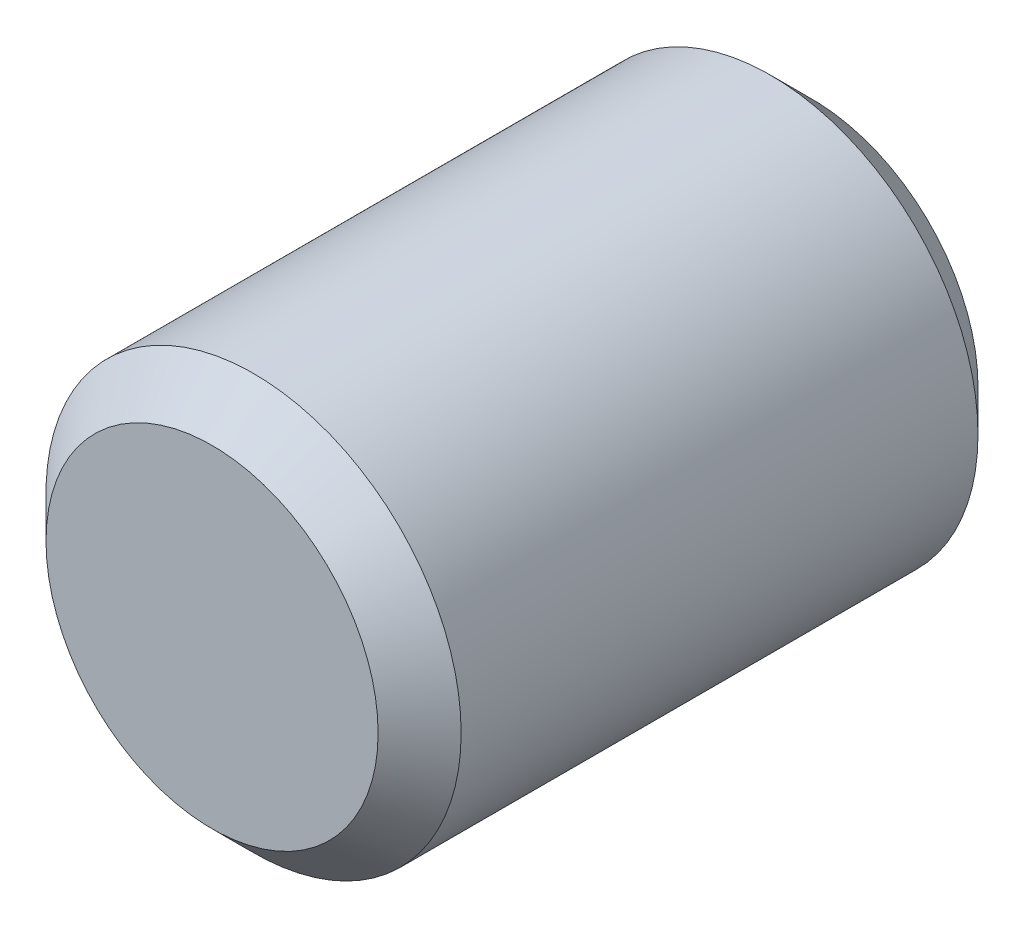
ISO-10303-21;
HEADER;
FILE_DESCRIPTION(('STEP AP214'),'2;1');
FILE_NAME('part.step','',(''),(''),'','','');
FILE_SCHEMA(('AUTOMOTIVE_DESIGN { 1 0 10303 214 1 1 1 1 }'));
ENDSEC;
DATA;
#1=APPLICATION_CONTEXT('core data for automotive mechanical design processes');
#2=APPLICATION_PROTOCOL_DEFINITION('international standard','automotive_design',2000,#1);
#3=PRODUCT_CONTEXT('',#1,'mechanical');
#4=PRODUCT('Part','Part','',(#3));
#5=PRODUCT_RELATED_PRODUCT_CATEGORY('part','',(#4));
#6=PRODUCT_DEFINITION_FORMATION('','',#4);
#7=PRODUCT_DEFINITION_CONTEXT('part definition',#1,'design');
#8=PRODUCT_DEFINITION('design','',#6,#7);
#9=PRODUCT_DEFINITION_SHAPE('','',#8);
#10=(LENGTH_UNIT() NAMED_UNIT(*) SI_UNIT(.MILLI.,.METRE.));
#11=(NAMED_UNIT(*) PLANE_ANGLE_UNIT() SI_UNIT($,.RADIAN.));
#12=(NAMED_UNIT(*) SI_UNIT($,.STERADIAN.) SOLID_ANGLE_UNIT());
#13=UNCERTAINTY_MEASURE_WITH_UNIT(LENGTH_MEASURE(1.E-05),#10,'distance_accuracy_value','');
#14=(GEOMETRIC_REPRESENTATION_CONTEXT(3) GLOBAL_UNCERTAINTY_ASSIGNED_CONTEXT((#13)) GLOBAL_UNIT_ASSIGNED_CONTEXT((#10,
#11,#12)) REPRESENTATION_CONTEXT('',''));
#15=CARTESIAN_POINT('',(0.,0.,0.));
#16=DIRECTION('',(0.,0.,1.));
#17=DIRECTION('',(1.,0.,0.));
#18=AXIS2_PLACEMENT_3D('',#15,#16,#17);
#19=CARTESIAN_POINT('',(0.,-2.77555756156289E-13,14.45));
#20=DIRECTION('',(0.,0.,-1.));
#21=DIRECTION('',(-1.,0.,0.));
#22=AXIS2_PLACEMENT_3D('',#19,#20,#21);
#23=CYLINDRICAL_SURFACE('',#22,5.);
#24=CARTESIAN_POINT('',(0.,-2.77555756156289E-13,13.45));
#25=DIRECTION('',(0.,0.,1.));
#26=DIRECTION('',(1.,0.,0.));
#27=AXIS2_PLACEMENT_3D('',#24,#25,#26);
#28=CIRCLE('',#27,5.);
#29=CARTESIAN_POINT('',(5.,-2.77555756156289E-13,13.45));
#30=VERTEX_POINT('',#29);
#31=EDGE_CURVE('E28',#30,#30,#28,.F.);
#32=ORIENTED_EDGE('',*,*,#31,.T.);
#33=EDGE_LOOP('',(#32));
#34=FACE_BOUND('',#33,.T.);
#35=CARTESIAN_POINT('',(0.,-2.77555756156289E-13,1.));
#36=DIRECTION('',(0.,0.,1.));
#37=DIRECTION('',(1.,0.,0.));
#38=AXIS2_PLACEMENT_3D('',#35,#36,#37);
#39=CIRCLE('',#38,5.);
#40=CARTESIAN_POINT('',(5.,-2.77555756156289E-13,1.));
#41=VERTEX_POINT('',#40);
#42=EDGE_CURVE('E32',#41,#41,#39,.T.);
#43=ORIENTED_EDGE('',*,*,#42,.T.);
#44=EDGE_LOOP('',(#43));
#45=FACE_BOUND('',#44,.T.);
#46=ADVANCED_FACE('F22',(#34,#45),#23,.T.);
#47=CARTESIAN_POINT('',(0.,-2.77555756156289E-13,14.45));
#48=DIRECTION('',(0.,0.,1.));
#49=DIRECTION('',(1.,0.,0.));
#50=AXIS2_PLACEMENT_3D('',#47,#48,#49);
#51=PLANE('',#50);
#52=CARTESIAN_POINT('',(0.,-2.77555756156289E-13,14.45));
#53=DIRECTION('',(0.,0.,1.));
#54=DIRECTION('',(1.,0.,0.));
#55=AXIS2_PLACEMENT_3D('',#52,#53,#54);
#56=CIRCLE('',#55,4.);
#57=CARTESIAN_POINT('',(4.,-2.77555756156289E-13,14.45));
#58=VERTEX_POINT('',#57);
#59=EDGE_CURVE('E36',#58,#58,#56,.T.);
#60=ORIENTED_EDGE('',*,*,#59,.T.);
#61=EDGE_LOOP('',(#60));
#62=FACE_BOUND('',#61,.T.);
#63=ADVANCED_FACE('F42',(#62),#51,.T.);
#64=CARTESIAN_POINT('',(0.,-2.77555756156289E-13,0.));
#65=DIRECTION('',(0.,0.,1.));
#66=DIRECTION('',(1.,0.,0.));
#67=AXIS2_PLACEMENT_3D('',#64,#65,#66);
#68=PLANE('',#67);
#69=CARTESIAN_POINT('',(0.,-2.77555756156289E-13,0.));
#70=DIRECTION('',(0.,0.,1.));
#71=DIRECTION('',(1.,0.,0.));
#72=AXIS2_PLACEMENT_3D('',#69,#70,#71);
#73=CIRCLE('',#72,4.);
#74=CARTESIAN_POINT('',(4.,-2.77555756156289E-13,0.));
#75=VERTEX_POINT('',#74);
#76=EDGE_CURVE('E10',#75,#75,#73,.F.);
#77=ORIENTED_EDGE('',*,*,#76,.T.);
#78=EDGE_LOOP('',(#77));
#79=FACE_BOUND('',#78,.T.);
#80=ADVANCED_FACE('F47',(#79),#68,.F.);
#81=CARTESIAN_POINT('',(0.,-2.77555756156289E-13,14.45));
#82=DIRECTION('',(0.,0.,-1.));
#83=DIRECTION('',(-1.,0.,0.));
#84=AXIS2_PLACEMENT_3D('',#81,#82,#83);
#85=CONICAL_SURFACE('',#84,4.,0.785398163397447);
#86=ORIENTED_EDGE('',*,*,#31,.F.);
#87=EDGE_LOOP('',(#86));
#88=FACE_BOUND('',#87,.T.);
#89=ORIENTED_EDGE('',*,*,#59,.F.);
#90=EDGE_LOOP('',(#89));
#91=FACE_BOUND('',#90,.T.);
#92=ADVANCED_FACE('F44',(#88,#91),#85,.T.);
#93=CARTESIAN_POINT('',(0.,-2.77555756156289E-13,1.));
#94=DIRECTION('',(0.,0.,1.));
#95=DIRECTION('',(1.,0.,0.));
#96=AXIS2_PLACEMENT_3D('',#93,#94,#95);
#97=CONICAL_SURFACE('',#96,5.,0.78539816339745);
#98=ORIENTED_EDGE('',*,*,#76,.F.);
#99=EDGE_LOOP('',(#98));
#100=FACE_BOUND('',#99,.T.);
#101=ORIENTED_EDGE('',*,*,#42,.F.);
#102=EDGE_LOOP('',(#101));
#103=FACE_BOUND('',#102,.T.);
#104=ADVANCED_FACE('F46',(#100,#103),#97,.T.);
#105=CLOSED_SHELL('',(#46,#63,#80,#92,#104));
#106=MANIFOLD_SOLID_BREP('B2',#105);
#107=ADVANCED_BREP_SHAPE_REPRESENTATION('',(#18,#106),#14);
#108=SHAPE_DEFINITION_REPRESENTATION(#9,#107);
ENDSEC;
END-ISO-10303-21;
